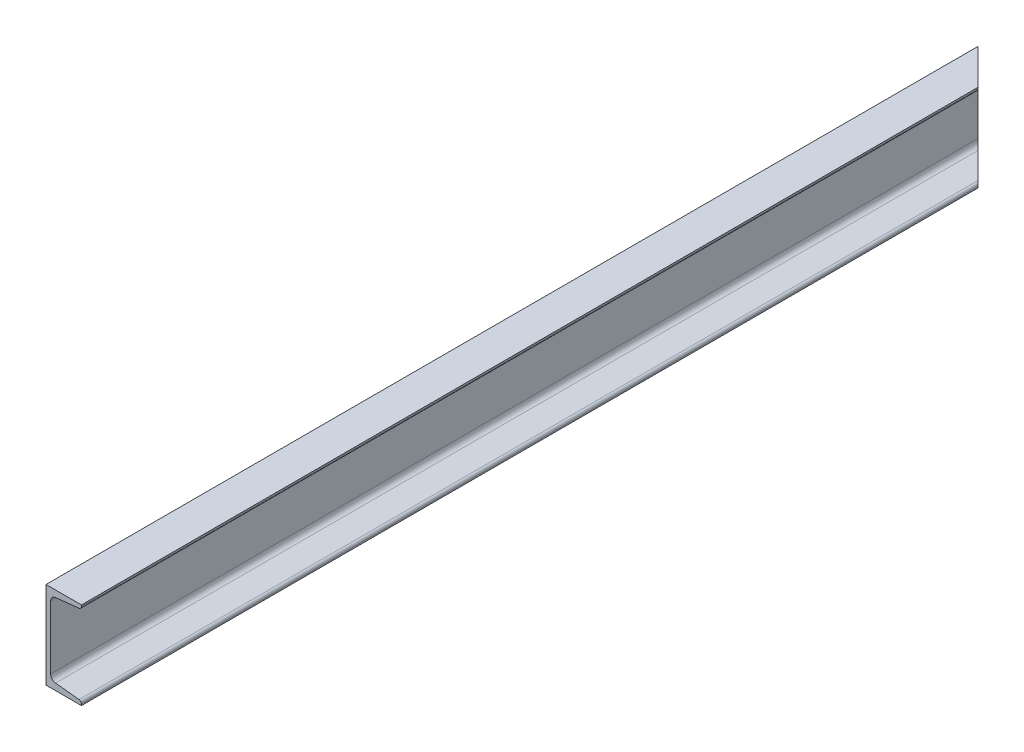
from build123d import *

# Parameters (mm, degrees)
EXTRUDE_1_DEPTH     = 855
CUT_EXTRUDE_1_DEPTH = 873.267160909


with BuildPart() as part:
    # Sketch 1 → Extrude 1 (new, symmetric)
    with BuildSketch(Plane.XY):
        with BuildLine():
            Line((0, 80), (0, -80))
            Line((0, -80), (65, -80))
            Line((65, -80), (65, -77.497140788))
            ThreePointArc((65, -77.497140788), (63.717527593, -74.153491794), (60.528004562, -72.52509783))
            Line((60.528004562, -72.52509783), (17.443990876, -67.949804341))
            ThreePointArc((17.443990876, -67.949804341), (11.064944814, -64.693016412), (8.5, -58.005718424))
            Line((8.5, -58.005718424), (8.5, 58.005718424))
            ThreePointArc((8.5, 58.005718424), (11.064944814, 64.693016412), (17.443990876, 67.949804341))
            Line((17.443990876, 67.949804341), (60.528004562, 72.52509783))
            ThreePointArc((60.528004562, 72.52509783), (63.717527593, 74.153491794), (65, 77.497140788))
            Line((65, 77.497140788), (65, 80))
            Line((65, 80), (0, 80))
        make_face()
    extrude(amount=EXTRUDE_1_DEPTH, both=True)

    # Sketch 2 → Cut-Extrude 1 (cut, through all)
    with BuildSketch(Plane(origin=(0, 80, 0), x_dir=(-1, 0, 0), z_dir=(0, 1, 0))):
        Polygon((-65, -855), (0, -855), (-65, -790), align=None)
    extrude(amount=-CUT_EXTRUDE_1_DEPTH, mode=Mode.SUBTRACT)


solid = part.part
